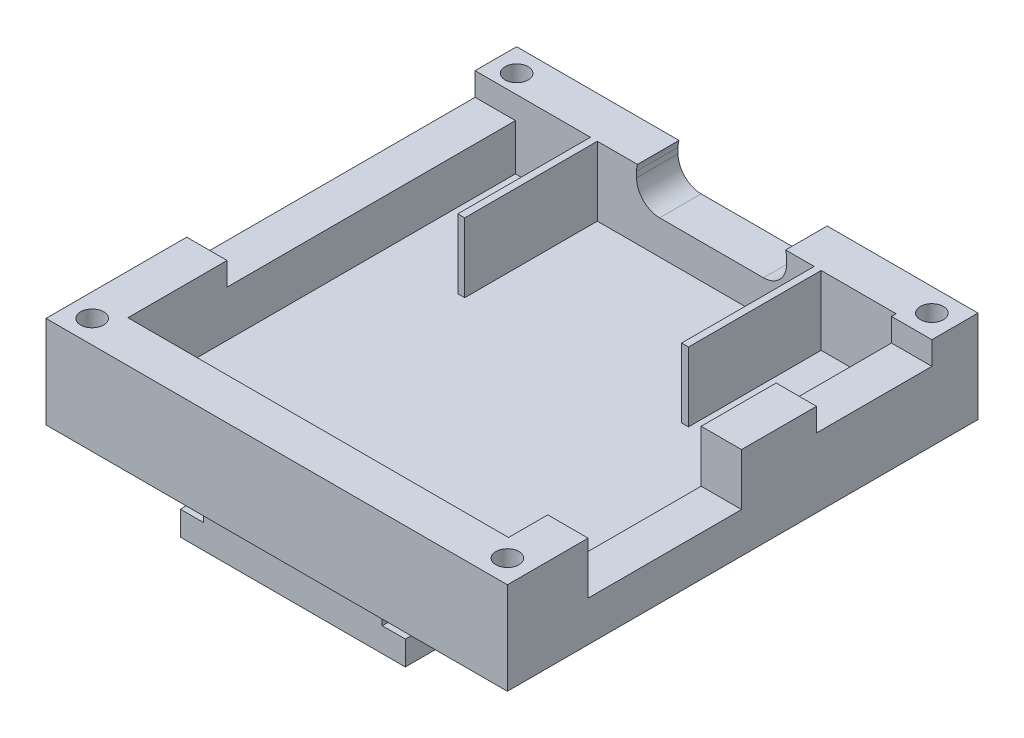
from build123d import *

# Parameters (mm, degrees)
BOSS_EXTRUDE1_DEPTH = 38
SKETCH2_W           = 40
SKETCH2_H           = 8
BOSS_EXTRUDE2_DEPTH = 1.4
SKETCH3_W           = 40
SKETCH3_H           = 8
BOSS_EXTRUDE3_DEPTH = 1.4
SKETCH4_W           = 33
SKETCH4_H           = 33.6
CUT_EXTRUDE1_DEPTH  = 6
SKETCH7_W           = 25
SKETCH7_H           = 4
CUT_EXTRUDE3_DEPTH  = 12
SKETCH9_W           = 10
SKETCH9_H           = 4
SKETCH9_W_2         = 13.3
SKETCH9_H_2         = 9
CUT_EXTRUDE4_DEPTH  = 7
CUT_EXTRUDE5_DEPTH  = 7
SKETCH11_R          = 1
CUT_EXTRUDE6_DEPTH  = 4
SKETCH8_W           = 0.6
SKETCH8_H           = 11.5
BOSS_EXTRUDE4_DEPTH = 6


with BuildPart() as part:
    # Sketch1 → Boss-Extrude1 (new body)
    with BuildSketch(Plane.XY):
        Polygon((7.75, 2.1), (9.75, 2.1), (9.75, 0), (-9.75, 0), (-9.75, 2.1), (-7.75, 2.1), (-7.75, 4), (-20, 4), (-20, 12), (20, 12), (20, 4), (7.75, 4), align=None)
    extrude(amount=BOSS_EXTRUDE1_DEPTH)

    # Sketch2 → Boss-Extrude2 (add)
    with BuildSketch(Plane.XY.offset(38)):
        with Locations((0, 8)):
            Rectangle(SKETCH2_W, SKETCH2_H)
    extrude(amount=BOSS_EXTRUDE2_DEPTH)

    # Sketch3 → Boss-Extrude3 (add)
    with BuildSketch(Plane(origin=(0, 0, 0), x_dir=(-1, 0, 0), z_dir=(0, 0, -1))):
        with Locations((0, 8)):
            Rectangle(SKETCH3_W, SKETCH3_H)
    extrude(amount=BOSS_EXTRUDE3_DEPTH)

    # Sketch4 → Cut-Extrude1 (cut)
    with BuildSketch(Plane(origin=(0, 12, 0), x_dir=(1, 0, 0), z_dir=(0, 1, 0))):
        with Locations((0, -19)):
            Rectangle(SKETCH4_W, SKETCH4_H)
    extrude(amount=-CUT_EXTRUDE1_DEPTH, mode=Mode.SUBTRACT)

    # Sketch7 → Cut-Extrude3 (cut)
    with BuildSketch(Plane.ZY.offset(20)):
        with Locations((14.7, 12)):
            Rectangle(SKETCH7_W, SKETCH7_H)
    extrude(amount=-CUT_EXTRUDE3_DEPTH, mode=Mode.SUBTRACT)

    # Sketch9 → Cut-Extrude4 (cut)
    with BuildSketch(Plane(origin=(20, 0, 0), x_dir=(0, 0, -1), z_dir=(1, 0, 0))):
        with Locations((-7.6, 12)):
            Rectangle(SKETCH9_W, SKETCH9_H)
        with Locations((-25.75, 12)):
            Rectangle(SKETCH9_W_2, SKETCH9_H_2)
    extrude(amount=-CUT_EXTRUDE4_DEPTH, mode=Mode.SUBTRACT)

    # Sketch10 → Cut-Extrude5 (cut)
    with BuildSketch(Plane(origin=(0, 0, -1.4), x_dir=(-1, 0, 0), z_dir=(0, 0, -1))):
        with BuildLine():
            Line((-5, 13.45), (4, 13.45))
            ThreePointArc((4, 13.45), (5.414213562, 12.864213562), (6, 11.45))
            Line((6, 11.45), (6, 10.95))
            ThreePointArc((6, 10.95), (5.414213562, 9.535786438), (4, 8.95))
            Line((4, 8.95), (-5, 8.95))
            ThreePointArc((-5, 8.95), (-6.414213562, 9.535786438), (-7, 10.95))
            Line((-7, 10.95), (-7, 11.45))
            ThreePointArc((-7, 11.45), (-6.414213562, 12.864213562), (-5, 13.45))
        make_face()
    extrude(amount=-CUT_EXTRUDE5_DEPTH, mode=Mode.SUBTRACT)

    # Sketch11 → Cut-Extrude6 (cut)
    with BuildSketch(Plane(origin=(0, 12, 0), x_dir=(1, 0, 0), z_dir=(0, 1, 0))):
        with Locations(Location((-18, -37.4, 0), (0, 0, 270))):
            Circle(SKETCH11_R)
        with Locations(Location((18, -37.4, 0), (0, 0, 270))):
            Circle(SKETCH11_R)
        with Locations(Location((-18, -0.6, 0), (0, 0, 270))):
            Circle(SKETCH11_R)
        with Locations(Location((18, -0.6, 0), (0, 0, 270))):
            Circle(SKETCH11_R)
    extrude(amount=-CUT_EXTRUDE6_DEPTH, mode=Mode.SUBTRACT)

    # Sketch8 → Boss-Extrude4 (add)
    with BuildSketch(Plane(origin=(0, 6, 0), x_dir=(1, 0, 0), z_dir=(0, 1, 0))):
        with Locations((-9.7, -7.95)):
            Rectangle(SKETCH8_W, SKETCH8_H)
        with Locations((9.7, -7.95)):
            Rectangle(SKETCH8_W, SKETCH8_H)
    extrude(amount=BOSS_EXTRUDE4_DEPTH)


solid = part.part
